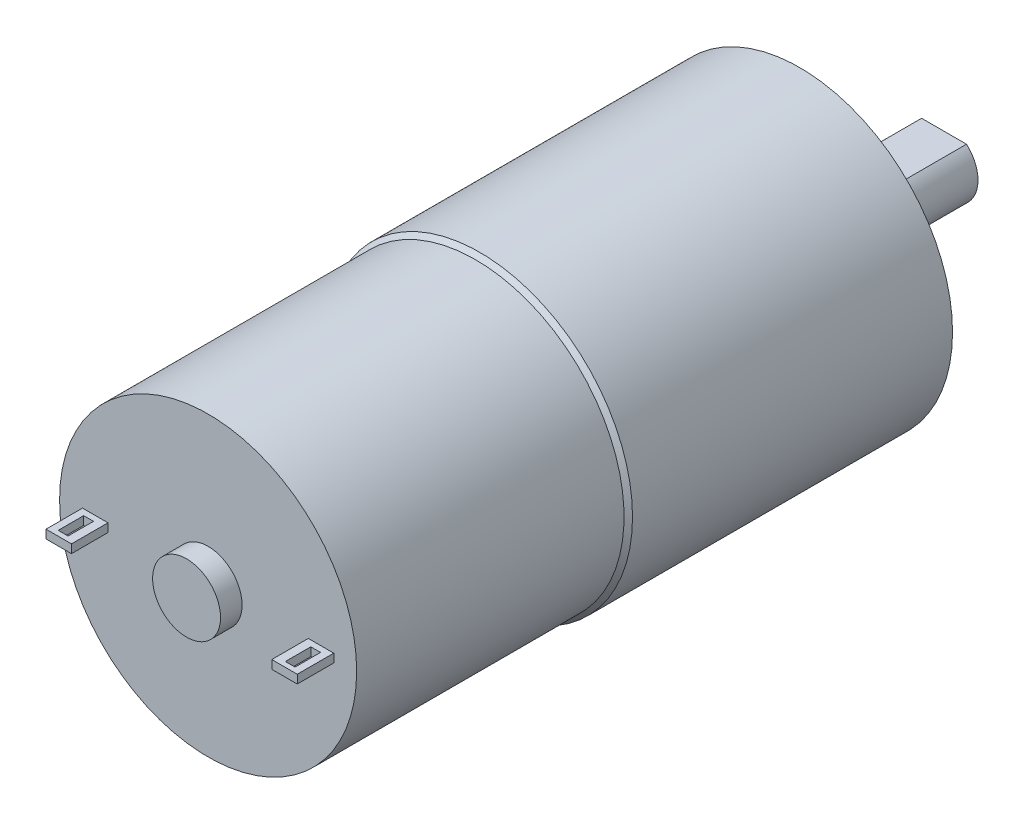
ISO-10303-21;
HEADER;
FILE_DESCRIPTION(('STEP AP214'),'2;1');
FILE_NAME('part.step','',(''),(''),'','','');
FILE_SCHEMA(('AUTOMOTIVE_DESIGN { 1 0 10303 214 1 1 1 1 }'));
ENDSEC;
DATA;
#1=APPLICATION_CONTEXT('core data for automotive mechanical design processes');
#2=APPLICATION_PROTOCOL_DEFINITION('international standard','automotive_design',2000,#1);
#3=PRODUCT_CONTEXT('',#1,'mechanical');
#4=PRODUCT('Part','Part','',(#3));
#5=PRODUCT_RELATED_PRODUCT_CATEGORY('part','',(#4));
#6=PRODUCT_DEFINITION_FORMATION('','',#4);
#7=PRODUCT_DEFINITION_CONTEXT('part definition',#1,'design');
#8=PRODUCT_DEFINITION('design','',#6,#7);
#9=PRODUCT_DEFINITION_SHAPE('','',#8);
#10=(LENGTH_UNIT() NAMED_UNIT(*) SI_UNIT(.MILLI.,.METRE.));
#11=(NAMED_UNIT(*) PLANE_ANGLE_UNIT() SI_UNIT($,.RADIAN.));
#12=(NAMED_UNIT(*) SI_UNIT($,.STERADIAN.) SOLID_ANGLE_UNIT());
#13=UNCERTAINTY_MEASURE_WITH_UNIT(LENGTH_MEASURE(1.E-05),#10,'distance_accuracy_value','');
#14=(GEOMETRIC_REPRESENTATION_CONTEXT(3) GLOBAL_UNCERTAINTY_ASSIGNED_CONTEXT((#13)) GLOBAL_UNIT_ASSIGNED_CONTEXT((#10,
#11,#12)) REPRESENTATION_CONTEXT('',''));
#15=CARTESIAN_POINT('',(0.,0.,0.));
#16=DIRECTION('',(0.,0.,1.));
#17=DIRECTION('',(1.,0.,0.));
#18=AXIS2_PLACEMENT_3D('',#15,#16,#17);
#19=CARTESIAN_POINT('',(0.,0.,69.7));
#20=DIRECTION('',(0.,0.,1.));
#21=DIRECTION('',(1.,0.,0.));
#22=AXIS2_PLACEMENT_3D('',#19,#20,#21);
#23=PLANE('',#22);
#24=CARTESIAN_POINT('',(0.,0.,69.7));
#25=DIRECTION('',(0.,0.,1.));
#26=DIRECTION('',(1.,0.,0.));
#27=AXIS2_PLACEMENT_3D('',#24,#25,#26);
#28=CIRCLE('',#27,4.);
#29=CARTESIAN_POINT('',(4.,0.,69.7));
#30=VERTEX_POINT('',#29);
#31=EDGE_CURVE('E11',#30,#30,#28,.T.);
#32=ORIENTED_EDGE('',*,*,#31,.F.);
#33=EDGE_LOOP('',(#32));
#34=FACE_BOUND('',#33,.T.);
#35=CARTESIAN_POINT('',(0.,0.,69.7));
#36=DIRECTION('',(0.,0.,1.));
#37=DIRECTION('',(1.,0.,0.));
#38=AXIS2_PLACEMENT_3D('',#35,#36,#37);
#39=CIRCLE('',#38,17.5);
#40=CARTESIAN_POINT('',(17.5,0.,69.7));
#41=VERTEX_POINT('',#40);
#42=EDGE_CURVE('E405',#41,#41,#39,.T.);
#43=ORIENTED_EDGE('',*,*,#42,.T.);
#44=EDGE_LOOP('',(#43));
#45=FACE_BOUND('',#44,.T.);
#46=DIRECTION('',(1.,0.,0.));
#47=VECTOR('',#46,1.);
#48=CARTESIAN_POINT('',(-14.8,-0.499999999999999,69.7));
#49=LINE('',#48,#47);
#50=CARTESIAN_POINT('',(-14.8,-0.499999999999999,69.7));
#51=VERTEX_POINT('',#50);
#52=CARTESIAN_POINT('',(-11.8,-0.499999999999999,69.7));
#53=VERTEX_POINT('',#52);
#54=EDGE_CURVE('E353',#51,#53,#49,.T.);
#55=ORIENTED_EDGE('',*,*,#54,.F.);
#56=DIRECTION('',(0.,-1.,0.));
#57=VECTOR('',#56,1.);
#58=CARTESIAN_POINT('',(-14.8,0.500000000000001,69.7));
#59=LINE('',#58,#57);
#60=CARTESIAN_POINT('',(-14.8,0.500000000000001,69.7));
#61=VERTEX_POINT('',#60);
#62=EDGE_CURVE('E306',#61,#51,#59,.T.);
#63=ORIENTED_EDGE('',*,*,#62,.F.);
#64=DIRECTION('',(1.,0.,0.));
#65=VECTOR('',#64,1.);
#66=CARTESIAN_POINT('',(-14.8,0.500000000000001,69.7));
#67=LINE('',#66,#65);
#68=CARTESIAN_POINT('',(-11.8,0.500000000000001,69.7));
#69=VERTEX_POINT('',#68);
#70=EDGE_CURVE('E346',#61,#69,#67,.T.);
#71=ORIENTED_EDGE('',*,*,#70,.T.);
#72=DIRECTION('',(0.,-1.,0.));
#73=VECTOR('',#72,1.);
#74=CARTESIAN_POINT('',(-11.8,0.500000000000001,69.7));
#75=LINE('',#74,#73);
#76=EDGE_CURVE('E349',#69,#53,#75,.T.);
#77=ORIENTED_EDGE('',*,*,#76,.T.);
#78=EDGE_LOOP('',(#55,#63,#71,#77));
#79=FACE_BOUND('',#78,.T.);
#80=DIRECTION('',(1.,0.,0.));
#81=VECTOR('',#80,1.);
#82=CARTESIAN_POINT('',(11.8,-0.5,69.7));
#83=LINE('',#82,#81);
#84=CARTESIAN_POINT('',(11.8,-0.5,69.7));
#85=VERTEX_POINT('',#84);
#86=CARTESIAN_POINT('',(14.8,-0.5,69.7));
#87=VERTEX_POINT('',#86);
#88=EDGE_CURVE('E305',#85,#87,#83,.T.);
#89=ORIENTED_EDGE('',*,*,#88,.F.);
#90=DIRECTION('',(0.,-1.,0.));
#91=VECTOR('',#90,1.);
#92=CARTESIAN_POINT('',(11.8,0.5,69.7));
#93=LINE('',#92,#91);
#94=CARTESIAN_POINT('',(11.8,0.5,69.7));
#95=VERTEX_POINT('',#94);
#96=EDGE_CURVE('E301',#95,#85,#93,.T.);
#97=ORIENTED_EDGE('',*,*,#96,.F.);
#98=DIRECTION('',(1.,0.,0.));
#99=VECTOR('',#98,1.);
#100=CARTESIAN_POINT('',(11.8,0.5,69.7));
#101=LINE('',#100,#99);
#102=CARTESIAN_POINT('',(14.8,0.5,69.7));
#103=VERTEX_POINT('',#102);
#104=EDGE_CURVE('E289',#95,#103,#101,.T.);
#105=ORIENTED_EDGE('',*,*,#104,.T.);
#106=DIRECTION('',(0.,-1.,0.));
#107=VECTOR('',#106,1.);
#108=CARTESIAN_POINT('',(14.8,0.5,69.7));
#109=LINE('',#108,#107);
#110=EDGE_CURVE('E310',#103,#87,#109,.T.);
#111=ORIENTED_EDGE('',*,*,#110,.T.);
#112=EDGE_LOOP('',(#89,#97,#105,#111));
#113=FACE_BOUND('',#112,.T.);
#114=ADVANCED_FACE('F55',(#34,#45,#79,#113),#23,.T.);
#115=CARTESIAN_POINT('',(0.,0.,38.7));
#116=DIRECTION('',(0.,0.,-1.));
#117=DIRECTION('',(-1.,0.,0.));
#118=AXIS2_PLACEMENT_3D('',#115,#116,#117);
#119=CYLINDRICAL_SURFACE('',#118,18.);
#120=CARTESIAN_POINT('',(0.,0.,37.7));
#121=DIRECTION('',(0.,0.,1.));
#122=DIRECTION('',(1.,0.,0.));
#123=AXIS2_PLACEMENT_3D('',#120,#121,#122);
#124=CIRCLE('',#123,18.);
#125=CARTESIAN_POINT('',(18.,0.,37.7));
#126=VERTEX_POINT('',#125);
#127=EDGE_CURVE('E415',#126,#126,#124,.F.);
#128=ORIENTED_EDGE('',*,*,#127,.T.);
#129=EDGE_LOOP('',(#128));
#130=FACE_BOUND('',#129,.T.);
#131=CARTESIAN_POINT('',(0.,0.,0.));
#132=DIRECTION('',(0.,0.,1.));
#133=DIRECTION('',(1.,0.,0.));
#134=AXIS2_PLACEMENT_3D('',#131,#132,#133);
#135=CIRCLE('',#134,18.);
#136=CARTESIAN_POINT('',(18.,0.,0.));
#137=VERTEX_POINT('',#136);
#138=EDGE_CURVE('E412',#137,#137,#135,.T.);
#139=ORIENTED_EDGE('',*,*,#138,.T.);
#140=EDGE_LOOP('',(#139));
#141=FACE_BOUND('',#140,.T.);
#142=ADVANCED_FACE('F443',(#130,#141),#119,.T.);
#143=CARTESIAN_POINT('',(0.,0.,0.));
#144=DIRECTION('',(0.,0.,1.));
#145=DIRECTION('',(1.,0.,0.));
#146=AXIS2_PLACEMENT_3D('',#143,#144,#145);
#147=PLANE('',#146);
#148=CARTESIAN_POINT('',(0.,0.,0.));
#149=DIRECTION('',(0.,0.,-1.));
#150=DIRECTION('',(-1.,0.,0.));
#151=AXIS2_PLACEMENT_3D('',#148,#149,#150);
#152=CIRCLE('',#151,11.);
#153=CARTESIAN_POINT('',(-11.,0.,0.));
#154=VERTEX_POINT('',#153);
#155=EDGE_CURVE('E402',#154,#154,#152,.T.);
#156=ORIENTED_EDGE('',*,*,#155,.F.);
#157=EDGE_LOOP('',(#156));
#158=FACE_BOUND('',#157,.T.);
#159=ORIENTED_EDGE('',*,*,#138,.F.);
#160=EDGE_LOOP('',(#159));
#161=FACE_BOUND('',#160,.T.);
#162=ADVANCED_FACE('F440',(#158,#161),#147,.F.);
#163=CARTESIAN_POINT('',(0.,0.,69.7));
#164=DIRECTION('',(0.,0.,-1.));
#165=DIRECTION('',(-1.,0.,0.));
#166=AXIS2_PLACEMENT_3D('',#163,#164,#165);
#167=CYLINDRICAL_SURFACE('',#166,17.5);
#168=CARTESIAN_POINT('',(0.,0.,38.2));
#169=DIRECTION('',(0.,0.,-1.));
#170=DIRECTION('',(-1.,0.,0.));
#171=AXIS2_PLACEMENT_3D('',#168,#169,#170);
#172=CIRCLE('',#171,17.5);
#173=CARTESIAN_POINT('',(-17.5,0.,38.2));
#174=VERTEX_POINT('',#173);
#175=EDGE_CURVE('E60',#174,#174,#172,.F.);
#176=ORIENTED_EDGE('',*,*,#175,.T.);
#177=EDGE_LOOP('',(#176));
#178=FACE_BOUND('',#177,.T.);
#179=ORIENTED_EDGE('',*,*,#42,.F.);
#180=EDGE_LOOP('',(#179));
#181=FACE_BOUND('',#180,.T.);
#182=ADVANCED_FACE('F426',(#178,#181),#167,.T.);
#183=CARTESIAN_POINT('',(0.,0.,38.7));
#184=DIRECTION('',(0.,0.,-1.));
#185=DIRECTION('',(-1.,0.,0.));
#186=AXIS2_PLACEMENT_3D('',#183,#184,#185);
#187=CONICAL_SURFACE('',#186,17.,0.785398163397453);
#188=ORIENTED_EDGE('',*,*,#127,.F.);
#189=EDGE_LOOP('',(#188));
#190=FACE_BOUND('',#189,.T.);
#191=ORIENTED_EDGE('',*,*,#175,.F.);
#192=EDGE_LOOP('',(#191));
#193=FACE_BOUND('',#192,.T.);
#194=ADVANCED_FACE('F58',(#190,#193),#187,.T.);
#195=CARTESIAN_POINT('',(0.,0.,-2.));
#196=DIRECTION('',(0.,0.,1.));
#197=DIRECTION('',(1.,0.,0.));
#198=AXIS2_PLACEMENT_3D('',#195,#196,#197);
#199=CYLINDRICAL_SURFACE('',#198,11.);
#200=CARTESIAN_POINT('',(0.,0.,-2.));
#201=DIRECTION('',(0.,0.,-1.));
#202=DIRECTION('',(-1.,0.,0.));
#203=AXIS2_PLACEMENT_3D('',#200,#201,#202);
#204=CIRCLE('',#203,11.);
#205=CARTESIAN_POINT('',(-11.,0.,-2.));
#206=VERTEX_POINT('',#205);
#207=EDGE_CURVE('E398',#206,#206,#204,.T.);
#208=ORIENTED_EDGE('',*,*,#207,.F.);
#209=EDGE_LOOP('',(#208));
#210=FACE_BOUND('',#209,.T.);
#211=ORIENTED_EDGE('',*,*,#155,.T.);
#212=EDGE_LOOP('',(#211));
#213=FACE_BOUND('',#212,.T.);
#214=ADVANCED_FACE('F430',(#210,#213),#199,.T.);
#215=CARTESIAN_POINT('',(0.,0.,-2.));
#216=DIRECTION('',(0.,0.,-1.));
#217=DIRECTION('',(-1.,0.,0.));
#218=AXIS2_PLACEMENT_3D('',#215,#216,#217);
#219=PLANE('',#218);
#220=CARTESIAN_POINT('',(0.,0.,-2.));
#221=DIRECTION('',(0.,0.,-1.));
#222=DIRECTION('',(-1.,0.,0.));
#223=AXIS2_PLACEMENT_3D('',#220,#221,#222);
#224=CIRCLE('',#223,4.);
#225=CARTESIAN_POINT('',(-4.,0.,-2.));
#226=VERTEX_POINT('',#225);
#227=EDGE_CURVE('E66',#226,#226,#224,.T.);
#228=ORIENTED_EDGE('',*,*,#227,.F.);
#229=EDGE_LOOP('',(#228));
#230=FACE_BOUND('',#229,.T.);
#231=ORIENTED_EDGE('',*,*,#207,.T.);
#232=EDGE_LOOP('',(#231));
#233=FACE_BOUND('',#232,.T.);
#234=ADVANCED_FACE('F436',(#230,#233),#219,.T.);
#235=CARTESIAN_POINT('',(0.,0.,-17.));
#236=DIRECTION('',(0.,0.,1.));
#237=DIRECTION('',(1.,0.,0.));
#238=AXIS2_PLACEMENT_3D('',#235,#236,#237);
#239=CYLINDRICAL_SURFACE('',#238,4.);
#240=CARTESIAN_POINT('',(0.,0.,-17.));
#241=DIRECTION('',(0.,0.,-1.));
#242=DIRECTION('',(-1.,0.,0.));
#243=AXIS2_PLACEMENT_3D('',#240,#241,#242);
#244=CIRCLE('',#243,4.);
#245=CARTESIAN_POINT('',(2.64575131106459,3.,-17.));
#246=VERTEX_POINT('',#245);
#247=CARTESIAN_POINT('',(-2.64575131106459,3.,-17.));
#248=VERTEX_POINT('',#247);
#249=EDGE_CURVE('E391',#246,#248,#244,.T.);
#250=ORIENTED_EDGE('',*,*,#249,.F.);
#251=DIRECTION('',(0.,0.,-1.));
#252=VECTOR('',#251,1.);
#253=CARTESIAN_POINT('',(2.64575131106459,3.,-5.));
#254=LINE('',#253,#252);
#255=CARTESIAN_POINT('',(2.64575131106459,3.,-5.));
#256=VERTEX_POINT('',#255);
#257=EDGE_CURVE('E388',#256,#246,#254,.T.);
#258=ORIENTED_EDGE('',*,*,#257,.F.);
#259=CARTESIAN_POINT('',(0.,0.,-5.));
#260=DIRECTION('',(0.,0.,-1.));
#261=DIRECTION('',(-1.,0.,0.));
#262=AXIS2_PLACEMENT_3D('',#259,#260,#261);
#263=CIRCLE('',#262,4.);
#264=CARTESIAN_POINT('',(-2.64575131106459,3.,-5.));
#265=VERTEX_POINT('',#264);
#266=EDGE_CURVE('E381',#265,#256,#263,.T.);
#267=ORIENTED_EDGE('',*,*,#266,.F.);
#268=DIRECTION('',(0.,0.,-1.));
#269=VECTOR('',#268,1.);
#270=CARTESIAN_POINT('',(-2.64575131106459,3.,-5.));
#271=LINE('',#270,#269);
#272=EDGE_CURVE('E385',#265,#248,#271,.T.);
#273=ORIENTED_EDGE('',*,*,#272,.T.);
#274=EDGE_LOOP('',(#250,#258,#267,#273));
#275=FACE_BOUND('',#274,.T.);
#276=ORIENTED_EDGE('',*,*,#227,.T.);
#277=EDGE_LOOP('',(#276));
#278=FACE_BOUND('',#277,.T.);
#279=ADVANCED_FACE('F476',(#275,#278),#239,.T.);
#280=CARTESIAN_POINT('',(0.,0.,-17.));
#281=DIRECTION('',(0.,0.,-1.));
#282=DIRECTION('',(-1.,0.,0.));
#283=AXIS2_PLACEMENT_3D('',#280,#281,#282);
#284=PLANE('',#283);
#285=DIRECTION('',(-1.,0.,0.));
#286=VECTOR('',#285,1.);
#287=CARTESIAN_POINT('',(2.64575131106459,3.,-17.));
#288=LINE('',#287,#286);
#289=EDGE_CURVE('E375',#246,#248,#288,.T.);
#290=ORIENTED_EDGE('',*,*,#289,.F.);
#291=ORIENTED_EDGE('',*,*,#249,.T.);
#292=EDGE_LOOP('',(#290,#291));
#293=FACE_BOUND('',#292,.T.);
#294=ADVANCED_FACE('F483',(#293),#284,.T.);
#295=CARTESIAN_POINT('',(2.64575131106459,3.,-5.));
#296=DIRECTION('',(0.,-1.,0.));
#297=DIRECTION('',(0.,0.,-1.));
#298=AXIS2_PLACEMENT_3D('',#295,#296,#297);
#299=PLANE('',#298);
#300=ORIENTED_EDGE('',*,*,#289,.T.);
#301=ORIENTED_EDGE('',*,*,#272,.F.);
#302=DIRECTION('',(-1.,0.,0.));
#303=VECTOR('',#302,1.);
#304=CARTESIAN_POINT('',(2.64575131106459,3.,-5.));
#305=LINE('',#304,#303);
#306=EDGE_CURVE('E377',#256,#265,#305,.T.);
#307=ORIENTED_EDGE('',*,*,#306,.F.);
#308=ORIENTED_EDGE('',*,*,#257,.T.);
#309=EDGE_LOOP('',(#300,#301,#307,#308));
#310=FACE_BOUND('',#309,.T.);
#311=ADVANCED_FACE('F491',(#310),#299,.F.);
#312=CARTESIAN_POINT('',(0.,0.,-5.));
#313=DIRECTION('',(0.,0.,-1.));
#314=DIRECTION('',(-1.,0.,0.));
#315=AXIS2_PLACEMENT_3D('',#312,#313,#314);
#316=PLANE('',#315);
#317=ORIENTED_EDGE('',*,*,#306,.T.);
#318=ORIENTED_EDGE('',*,*,#266,.T.);
#319=EDGE_LOOP('',(#317,#318));
#320=FACE_BOUND('',#319,.T.);
#321=ADVANCED_FACE('F752',(#320),#316,.T.);
#322=CARTESIAN_POINT('',(0.,0.,72.24));
#323=DIRECTION('',(0.,0.,-1.));
#324=DIRECTION('',(-1.,0.,0.));
#325=AXIS2_PLACEMENT_3D('',#322,#323,#324);
#326=CYLINDRICAL_SURFACE('',#325,4.);
#327=CARTESIAN_POINT('',(0.,0.,72.24));
#328=DIRECTION('',(0.,0.,1.));
#329=DIRECTION('',(1.,0.,0.));
#330=AXIS2_PLACEMENT_3D('',#327,#328,#329);
#331=CIRCLE('',#330,4.);
#332=CARTESIAN_POINT('',(4.,0.,72.24));
#333=VERTEX_POINT('',#332);
#334=EDGE_CURVE('E329',#333,#333,#331,.T.);
#335=ORIENTED_EDGE('',*,*,#334,.F.);
#336=EDGE_LOOP('',(#335));
#337=FACE_BOUND('',#336,.T.);
#338=ORIENTED_EDGE('',*,*,#31,.T.);
#339=EDGE_LOOP('',(#338));
#340=FACE_BOUND('',#339,.T.);
#341=ADVANCED_FACE('F741',(#337,#340),#326,.T.);
#342=CARTESIAN_POINT('',(0.,0.,72.24));
#343=DIRECTION('',(0.,0.,1.));
#344=DIRECTION('',(1.,0.,0.));
#345=AXIS2_PLACEMENT_3D('',#342,#343,#344);
#346=PLANE('',#345);
#347=ORIENTED_EDGE('',*,*,#334,.T.);
#348=EDGE_LOOP('',(#347));
#349=FACE_BOUND('',#348,.T.);
#350=ADVANCED_FACE('F501',(#349),#346,.T.);
#351=CARTESIAN_POINT('',(-14.8,0.500000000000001,74.));
#352=DIRECTION('',(1.,0.,0.));
#353=DIRECTION('',(0.,0.,-1.));
#354=AXIS2_PLACEMENT_3D('',#351,#352,#353);
#355=PLANE('',#354);
#356=ORIENTED_EDGE('',*,*,#62,.T.);
#357=DIRECTION('',(0.,0.,-1.));
#358=VECTOR('',#357,1.);
#359=CARTESIAN_POINT('',(-14.8,-0.499999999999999,74.));
#360=LINE('',#359,#358);
#361=CARTESIAN_POINT('',(-14.8,-0.499999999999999,74.));
#362=VERTEX_POINT('',#361);
#363=EDGE_CURVE('E283',#362,#51,#360,.T.);
#364=ORIENTED_EDGE('',*,*,#363,.F.);
#365=DIRECTION('',(0.,-1.,0.));
#366=VECTOR('',#365,1.);
#367=CARTESIAN_POINT('',(-14.8,0.500000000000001,74.));
#368=LINE('',#367,#366);
#369=CARTESIAN_POINT('',(-14.8,0.500000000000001,74.));
#370=VERTEX_POINT('',#369);
#371=EDGE_CURVE('E350',#370,#362,#368,.T.);
#372=ORIENTED_EDGE('',*,*,#371,.F.);
#373=DIRECTION('',(0.,0.,-1.));
#374=VECTOR('',#373,1.);
#375=CARTESIAN_POINT('',(-14.8,0.500000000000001,74.));
#376=LINE('',#375,#374);
#377=EDGE_CURVE('E341',#370,#61,#376,.T.);
#378=ORIENTED_EDGE('',*,*,#377,.T.);
#379=EDGE_LOOP('',(#356,#364,#372,#378));
#380=FACE_BOUND('',#379,.T.);
#381=ADVANCED_FACE('F497',(#380),#355,.F.);
#382=CARTESIAN_POINT('',(-14.8,-0.499999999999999,74.));
#383=DIRECTION('',(0.,1.,0.));
#384=DIRECTION('',(0.,0.,1.));
#385=AXIS2_PLACEMENT_3D('',#382,#383,#384);
#386=PLANE('',#385);
#387=DIRECTION('',(1.,0.,0.));
#388=VECTOR('',#387,1.);
#389=CARTESIAN_POINT('',(-14.8,-0.499999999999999,73.4));
#390=LINE('',#389,#388);
#391=CARTESIAN_POINT('',(-13.9628480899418,-0.5,73.4));
#392=VERTEX_POINT('',#391);
#393=CARTESIAN_POINT('',(-12.8,-0.5,73.4));
#394=VERTEX_POINT('',#393);
#395=EDGE_CURVE('E275',#392,#394,#390,.T.);
#396=ORIENTED_EDGE('',*,*,#395,.T.);
#397=DIRECTION('',(0.,0.,-1.));
#398=VECTOR('',#397,1.);
#399=CARTESIAN_POINT('',(-12.8,-0.499999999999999,74.));
#400=LINE('',#399,#398);
#401=CARTESIAN_POINT('',(-12.8,-0.5,70.4));
#402=VERTEX_POINT('',#401);
#403=EDGE_CURVE('E279',#394,#402,#400,.T.);
#404=ORIENTED_EDGE('',*,*,#403,.T.);
#405=DIRECTION('',(-1.,0.,0.));
#406=VECTOR('',#405,1.);
#407=CARTESIAN_POINT('',(-14.8,-0.499999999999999,70.4));
#408=LINE('',#407,#406);
#409=CARTESIAN_POINT('',(-13.9628480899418,-0.499999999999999,70.4));
#410=VERTEX_POINT('',#409);
#411=EDGE_CURVE('E267',#402,#410,#408,.T.);
#412=ORIENTED_EDGE('',*,*,#411,.T.);
#413=DIRECTION('',(0.,0.,1.));
#414=VECTOR('',#413,1.);
#415=CARTESIAN_POINT('',(-13.9628480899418,-0.499999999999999,74.));
#416=LINE('',#415,#414);
#417=EDGE_CURVE('E271',#410,#392,#416,.T.);
#418=ORIENTED_EDGE('',*,*,#417,.T.);
#419=EDGE_LOOP('',(#396,#404,#412,#418));
#420=FACE_BOUND('',#419,.T.);
#421=ORIENTED_EDGE('',*,*,#54,.T.);
#422=DIRECTION('',(0.,0.,-1.));
#423=VECTOR('',#422,1.);
#424=CARTESIAN_POINT('',(-11.8,-0.499999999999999,74.));
#425=LINE('',#424,#423);
#426=CARTESIAN_POINT('',(-11.8,-0.499999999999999,74.));
#427=VERTEX_POINT('',#426);
#428=EDGE_CURVE('E333',#427,#53,#425,.T.);
#429=ORIENTED_EDGE('',*,*,#428,.F.);
#430=DIRECTION('',(1.,0.,0.));
#431=VECTOR('',#430,1.);
#432=CARTESIAN_POINT('',(-14.8,-0.499999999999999,74.));
#433=LINE('',#432,#431);
#434=EDGE_CURVE('E367',#362,#427,#433,.T.);
#435=ORIENTED_EDGE('',*,*,#434,.F.);
#436=ORIENTED_EDGE('',*,*,#363,.T.);
#437=EDGE_LOOP('',(#421,#429,#435,#436));
#438=FACE_BOUND('',#437,.T.);
#439=ADVANCED_FACE('F500',(#420,#438),#386,.F.);
#440=CARTESIAN_POINT('',(-11.8,0.500000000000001,74.));
#441=DIRECTION('',(1.,0.,0.));
#442=DIRECTION('',(0.,0.,-1.));
#443=AXIS2_PLACEMENT_3D('',#440,#441,#442);
#444=PLANE('',#443);
#445=ORIENTED_EDGE('',*,*,#76,.F.);
#446=DIRECTION('',(0.,0.,-1.));
#447=VECTOR('',#446,1.);
#448=CARTESIAN_POINT('',(-11.8,0.500000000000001,74.));
#449=LINE('',#448,#447);
#450=CARTESIAN_POINT('',(-11.8,0.500000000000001,74.));
#451=VERTEX_POINT('',#450);
#452=EDGE_CURVE('E337',#451,#69,#449,.T.);
#453=ORIENTED_EDGE('',*,*,#452,.F.);
#454=DIRECTION('',(0.,-1.,0.));
#455=VECTOR('',#454,1.);
#456=CARTESIAN_POINT('',(-11.8,0.500000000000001,74.));
#457=LINE('',#456,#455);
#458=EDGE_CURVE('E363',#451,#427,#457,.T.);
#459=ORIENTED_EDGE('',*,*,#458,.T.);
#460=ORIENTED_EDGE('',*,*,#428,.T.);
#461=EDGE_LOOP('',(#445,#453,#459,#460));
#462=FACE_BOUND('',#461,.T.);
#463=ADVANCED_FACE('F509',(#462),#444,.T.);
#464=CARTESIAN_POINT('',(-14.8,0.500000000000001,74.));
#465=DIRECTION('',(0.,1.,0.));
#466=DIRECTION('',(0.,0.,1.));
#467=AXIS2_PLACEMENT_3D('',#464,#465,#466);
#468=PLANE('',#467);
#469=DIRECTION('',(0.,0.,-1.));
#470=VECTOR('',#469,1.);
#471=CARTESIAN_POINT('',(-12.8,0.5,70.4));
#472=LINE('',#471,#470);
#473=CARTESIAN_POINT('',(-12.8,0.5,73.4));
#474=VERTEX_POINT('',#473);
#475=CARTESIAN_POINT('',(-12.8,0.500000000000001,70.4));
#476=VERTEX_POINT('',#475);
#477=EDGE_CURVE('E82',#474,#476,#472,.T.);
#478=ORIENTED_EDGE('',*,*,#477,.F.);
#479=DIRECTION('',(1.,0.,0.));
#480=VECTOR('',#479,1.);
#481=CARTESIAN_POINT('',(-13.9628480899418,0.5,73.4));
#482=LINE('',#481,#480);
#483=CARTESIAN_POINT('',(-13.9628480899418,0.5,73.4));
#484=VERTEX_POINT('',#483);
#485=EDGE_CURVE('E234',#484,#474,#482,.T.);
#486=ORIENTED_EDGE('',*,*,#485,.F.);
#487=DIRECTION('',(0.,0.,1.));
#488=VECTOR('',#487,1.);
#489=CARTESIAN_POINT('',(-13.9628480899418,0.5,70.4));
#490=LINE('',#489,#488);
#491=CARTESIAN_POINT('',(-13.9628480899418,0.5,70.4));
#492=VERTEX_POINT('',#491);
#493=EDGE_CURVE('E246',#492,#484,#490,.T.);
#494=ORIENTED_EDGE('',*,*,#493,.F.);
#495=DIRECTION('',(-1.,0.,0.));
#496=VECTOR('',#495,1.);
#497=CARTESIAN_POINT('',(-13.9628480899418,0.5,70.4));
#498=LINE('',#497,#496);
#499=EDGE_CURVE('E250',#476,#492,#498,.T.);
#500=ORIENTED_EDGE('',*,*,#499,.F.);
#501=EDGE_LOOP('',(#478,#486,#494,#500));
#502=FACE_BOUND('',#501,.T.);
#503=ORIENTED_EDGE('',*,*,#70,.F.);
#504=ORIENTED_EDGE('',*,*,#377,.F.);
#505=DIRECTION('',(1.,0.,0.));
#506=VECTOR('',#505,1.);
#507=CARTESIAN_POINT('',(-14.8,0.500000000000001,74.));
#508=LINE('',#507,#506);
#509=EDGE_CURVE('E345',#370,#451,#508,.T.);
#510=ORIENTED_EDGE('',*,*,#509,.T.);
#511=ORIENTED_EDGE('',*,*,#452,.T.);
#512=EDGE_LOOP('',(#503,#504,#510,#511));
#513=FACE_BOUND('',#512,.T.);
#514=ADVANCED_FACE('F517',(#502,#513),#468,.T.);
#515=CARTESIAN_POINT('',(0.,0.,74.));
#516=DIRECTION('',(0.,0.,1.));
#517=DIRECTION('',(1.,0.,0.));
#518=AXIS2_PLACEMENT_3D('',#515,#516,#517);
#519=PLANE('',#518);
#520=ORIENTED_EDGE('',*,*,#371,.T.);
#521=ORIENTED_EDGE('',*,*,#434,.T.);
#522=ORIENTED_EDGE('',*,*,#458,.F.);
#523=ORIENTED_EDGE('',*,*,#509,.F.);
#524=EDGE_LOOP('',(#520,#521,#522,#523));
#525=FACE_BOUND('',#524,.T.);
#526=ADVANCED_FACE('F525',(#525),#519,.T.);
#527=CARTESIAN_POINT('',(11.8,0.5,74.));
#528=DIRECTION('',(1.,0.,0.));
#529=DIRECTION('',(0.,0.,-1.));
#530=AXIS2_PLACEMENT_3D('',#527,#528,#529);
#531=PLANE('',#530);
#532=ORIENTED_EDGE('',*,*,#96,.T.);
#533=DIRECTION('',(0.,0.,-1.));
#534=VECTOR('',#533,1.);
#535=CARTESIAN_POINT('',(11.8,-0.5,74.));
#536=LINE('',#535,#534);
#537=CARTESIAN_POINT('',(11.8,-0.5,74.));
#538=VERTEX_POINT('',#537);
#539=EDGE_CURVE('E325',#538,#85,#536,.T.);
#540=ORIENTED_EDGE('',*,*,#539,.F.);
#541=DIRECTION('',(0.,-1.,0.));
#542=VECTOR('',#541,1.);
#543=CARTESIAN_POINT('',(11.8,0.5,74.));
#544=LINE('',#543,#542);
#545=CARTESIAN_POINT('',(11.8,0.5,74.));
#546=VERTEX_POINT('',#545);
#547=EDGE_CURVE('E284',#546,#538,#544,.T.);
#548=ORIENTED_EDGE('',*,*,#547,.F.);
#549=DIRECTION('',(0.,0.,-1.));
#550=VECTOR('',#549,1.);
#551=CARTESIAN_POINT('',(11.8,0.5,74.));
#552=LINE('',#551,#550);
#553=EDGE_CURVE('E300',#546,#95,#552,.T.);
#554=ORIENTED_EDGE('',*,*,#553,.T.);
#555=EDGE_LOOP('',(#532,#540,#548,#554));
#556=FACE_BOUND('',#555,.T.);
#557=ADVANCED_FACE('F533',(#556),#531,.F.);
#558=CARTESIAN_POINT('',(11.8,-0.5,74.));
#559=DIRECTION('',(0.,1.,0.));
#560=DIRECTION('',(-1.,0.,0.));
#561=AXIS2_PLACEMENT_3D('',#558,#559,#560);
#562=PLANE('',#561);
#563=DIRECTION('',(1.,0.,0.));
#564=VECTOR('',#563,1.);
#565=CARTESIAN_POINT('',(11.8,-0.5,73.4));
#566=LINE('',#565,#564);
#567=CARTESIAN_POINT('',(12.8,-0.500000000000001,73.4));
#568=VERTEX_POINT('',#567);
#569=CARTESIAN_POINT('',(13.9428776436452,-0.500000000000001,73.4));
#570=VERTEX_POINT('',#569);
#571=EDGE_CURVE('E259',#568,#570,#566,.T.);
#572=ORIENTED_EDGE('',*,*,#571,.T.);
#573=DIRECTION('',(0.,0.,-1.));
#574=VECTOR('',#573,1.);
#575=CARTESIAN_POINT('',(13.9428776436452,-0.5,74.));
#576=LINE('',#575,#574);
#577=CARTESIAN_POINT('',(13.9428776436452,-0.500000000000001,70.4));
#578=VERTEX_POINT('',#577);
#579=EDGE_CURVE('E263',#570,#578,#576,.T.);
#580=ORIENTED_EDGE('',*,*,#579,.T.);
#581=DIRECTION('',(-1.,0.,0.));
#582=VECTOR('',#581,1.);
#583=CARTESIAN_POINT('',(11.8,-0.5,70.4));
#584=LINE('',#583,#582);
#585=CARTESIAN_POINT('',(12.8,-0.5,70.4));
#586=VERTEX_POINT('',#585);
#587=EDGE_CURVE('E226',#578,#586,#584,.T.);
#588=ORIENTED_EDGE('',*,*,#587,.T.);
#589=DIRECTION('',(0.,0.,1.));
#590=VECTOR('',#589,1.);
#591=CARTESIAN_POINT('',(12.8,-0.5,74.));
#592=LINE('',#591,#590);
#593=EDGE_CURVE('E193',#586,#568,#592,.T.);
#594=ORIENTED_EDGE('',*,*,#593,.T.);
#595=EDGE_LOOP('',(#572,#580,#588,#594));
#596=FACE_BOUND('',#595,.T.);
#597=ORIENTED_EDGE('',*,*,#88,.T.);
#598=DIRECTION('',(0.,0.,-1.));
#599=VECTOR('',#598,1.);
#600=CARTESIAN_POINT('',(14.8,-0.5,74.));
#601=LINE('',#600,#599);
#602=CARTESIAN_POINT('',(14.8,-0.5,74.));
#603=VERTEX_POINT('',#602);
#604=EDGE_CURVE('E321',#603,#87,#601,.T.);
#605=ORIENTED_EDGE('',*,*,#604,.F.);
#606=DIRECTION('',(1.,0.,0.));
#607=VECTOR('',#606,1.);
#608=CARTESIAN_POINT('',(11.8,-0.5,74.));
#609=LINE('',#608,#607);
#610=EDGE_CURVE('E288',#538,#603,#609,.T.);
#611=ORIENTED_EDGE('',*,*,#610,.F.);
#612=ORIENTED_EDGE('',*,*,#539,.T.);
#613=EDGE_LOOP('',(#597,#605,#611,#612));
#614=FACE_BOUND('',#613,.T.);
#615=ADVANCED_FACE('F541',(#596,#614),#562,.F.);
#616=CARTESIAN_POINT('',(14.8,0.5,74.));
#617=DIRECTION('',(1.,0.,0.));
#618=DIRECTION('',(0.,0.,-1.));
#619=AXIS2_PLACEMENT_3D('',#616,#617,#618);
#620=PLANE('',#619);
#621=ORIENTED_EDGE('',*,*,#110,.F.);
#622=DIRECTION('',(0.,0.,-1.));
#623=VECTOR('',#622,1.);
#624=CARTESIAN_POINT('',(14.8,0.5,74.));
#625=LINE('',#624,#623);
#626=CARTESIAN_POINT('',(14.8,0.5,74.));
#627=VERTEX_POINT('',#626);
#628=EDGE_CURVE('E317',#627,#103,#625,.T.);
#629=ORIENTED_EDGE('',*,*,#628,.F.);
#630=DIRECTION('',(0.,-1.,0.));
#631=VECTOR('',#630,1.);
#632=CARTESIAN_POINT('',(14.8,0.5,74.));
#633=LINE('',#632,#631);
#634=EDGE_CURVE('E292',#627,#603,#633,.T.);
#635=ORIENTED_EDGE('',*,*,#634,.T.);
#636=ORIENTED_EDGE('',*,*,#604,.T.);
#637=EDGE_LOOP('',(#621,#629,#635,#636));
#638=FACE_BOUND('',#637,.T.);
#639=ADVANCED_FACE('F549',(#638),#620,.T.);
#640=CARTESIAN_POINT('',(11.8,0.5,74.));
#641=DIRECTION('',(0.,1.,0.));
#642=DIRECTION('',(0.,0.,1.));
#643=AXIS2_PLACEMENT_3D('',#640,#641,#642);
#644=PLANE('',#643);
#645=DIRECTION('',(0.,0.,-1.));
#646=VECTOR('',#645,1.);
#647=CARTESIAN_POINT('',(13.9428776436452,0.5,73.4));
#648=LINE('',#647,#646);
#649=CARTESIAN_POINT('',(13.9428776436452,0.5,73.4));
#650=VERTEX_POINT('',#649);
#651=CARTESIAN_POINT('',(13.9428776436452,0.5,70.4));
#652=VERTEX_POINT('',#651);
#653=EDGE_CURVE('E208',#650,#652,#648,.T.);
#654=ORIENTED_EDGE('',*,*,#653,.F.);
#655=DIRECTION('',(1.,0.,0.));
#656=VECTOR('',#655,1.);
#657=CARTESIAN_POINT('',(12.8,0.5,73.4));
#658=LINE('',#657,#656);
#659=CARTESIAN_POINT('',(12.8,0.5,73.4));
#660=VERTEX_POINT('',#659);
#661=EDGE_CURVE('E213',#660,#650,#658,.T.);
#662=ORIENTED_EDGE('',*,*,#661,.F.);
#663=DIRECTION('',(0.,0.,1.));
#664=VECTOR('',#663,1.);
#665=CARTESIAN_POINT('',(12.8,0.5,73.4));
#666=LINE('',#665,#664);
#667=CARTESIAN_POINT('',(12.8,0.5,70.4));
#668=VERTEX_POINT('',#667);
#669=EDGE_CURVE('E190',#668,#660,#666,.T.);
#670=ORIENTED_EDGE('',*,*,#669,.F.);
#671=DIRECTION('',(-1.,0.,0.));
#672=VECTOR('',#671,1.);
#673=CARTESIAN_POINT('',(12.8,0.5,70.4));
#674=LINE('',#673,#672);
#675=EDGE_CURVE('E202',#652,#668,#674,.T.);
#676=ORIENTED_EDGE('',*,*,#675,.F.);
#677=EDGE_LOOP('',(#654,#662,#670,#676));
#678=FACE_BOUND('',#677,.T.);
#679=ORIENTED_EDGE('',*,*,#104,.F.);
#680=ORIENTED_EDGE('',*,*,#553,.F.);
#681=DIRECTION('',(1.,0.,0.));
#682=VECTOR('',#681,1.);
#683=CARTESIAN_POINT('',(11.8,0.5,74.));
#684=LINE('',#683,#682);
#685=EDGE_CURVE('E296',#546,#627,#684,.T.);
#686=ORIENTED_EDGE('',*,*,#685,.T.);
#687=ORIENTED_EDGE('',*,*,#628,.T.);
#688=EDGE_LOOP('',(#679,#680,#686,#687));
#689=FACE_BOUND('',#688,.T.);
#690=ADVANCED_FACE('F210',(#678,#689),#644,.T.);
#691=CARTESIAN_POINT('',(0.,0.,74.));
#692=DIRECTION('',(0.,0.,1.));
#693=DIRECTION('',(1.,0.,0.));
#694=AXIS2_PLACEMENT_3D('',#691,#692,#693);
#695=PLANE('',#694);
#696=ORIENTED_EDGE('',*,*,#547,.T.);
#697=ORIENTED_EDGE('',*,*,#610,.T.);
#698=ORIENTED_EDGE('',*,*,#634,.F.);
#699=ORIENTED_EDGE('',*,*,#685,.F.);
#700=EDGE_LOOP('',(#696,#697,#698,#699));
#701=FACE_BOUND('',#700,.T.);
#702=ADVANCED_FACE('F564',(#701),#695,.T.);
#703=CARTESIAN_POINT('',(13.9428776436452,-3.8,73.4));
#704=DIRECTION('',(1.,0.,0.));
#705=DIRECTION('',(0.,0.,-1.));
#706=AXIS2_PLACEMENT_3D('',#703,#704,#705);
#707=PLANE('',#706);
#708=DIRECTION('',(0.,1.,0.));
#709=VECTOR('',#708,1.);
#710=CARTESIAN_POINT('',(13.9428776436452,-3.8,73.4));
#711=LINE('',#710,#709);
#712=EDGE_CURVE('E223',#570,#650,#711,.T.);
#713=ORIENTED_EDGE('',*,*,#712,.T.);
#714=ORIENTED_EDGE('',*,*,#653,.T.);
#715=DIRECTION('',(0.,1.,0.));
#716=VECTOR('',#715,1.);
#717=CARTESIAN_POINT('',(13.9428776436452,-3.8,70.4));
#718=LINE('',#717,#716);
#719=EDGE_CURVE('E198',#578,#652,#718,.T.);
#720=ORIENTED_EDGE('',*,*,#719,.F.);
#721=ORIENTED_EDGE('',*,*,#579,.F.);
#722=EDGE_LOOP('',(#713,#714,#720,#721));
#723=FACE_BOUND('',#722,.T.);
#724=ADVANCED_FACE('F570',(#723),#707,.F.);
#725=CARTESIAN_POINT('',(12.8,-3.8,73.4));
#726=DIRECTION('',(0.,0.,1.));
#727=DIRECTION('',(1.,0.,0.));
#728=AXIS2_PLACEMENT_3D('',#725,#726,#727);
#729=PLANE('',#728);
#730=DIRECTION('',(0.,1.,0.));
#731=VECTOR('',#730,1.);
#732=CARTESIAN_POINT('',(12.8,-3.8,73.4));
#733=LINE('',#732,#731);
#734=EDGE_CURVE('E197',#568,#660,#733,.T.);
#735=ORIENTED_EDGE('',*,*,#734,.T.);
#736=ORIENTED_EDGE('',*,*,#661,.T.);
#737=ORIENTED_EDGE('',*,*,#712,.F.);
#738=ORIENTED_EDGE('',*,*,#571,.F.);
#739=EDGE_LOOP('',(#735,#736,#737,#738));
#740=FACE_BOUND('',#739,.T.);
#741=ADVANCED_FACE('F584',(#740),#729,.F.);
#742=CARTESIAN_POINT('',(12.8,-3.8,73.4));
#743=DIRECTION('',(-1.,0.,0.));
#744=DIRECTION('',(0.,0.,1.));
#745=AXIS2_PLACEMENT_3D('',#742,#743,#744);
#746=PLANE('',#745);
#747=DIRECTION('',(0.,1.,0.));
#748=VECTOR('',#747,1.);
#749=CARTESIAN_POINT('',(12.8,-3.8,70.4));
#750=LINE('',#749,#748);
#751=EDGE_CURVE('E185',#586,#668,#750,.T.);
#752=ORIENTED_EDGE('',*,*,#751,.T.);
#753=ORIENTED_EDGE('',*,*,#669,.T.);
#754=ORIENTED_EDGE('',*,*,#734,.F.);
#755=ORIENTED_EDGE('',*,*,#593,.F.);
#756=EDGE_LOOP('',(#752,#753,#754,#755));
#757=FACE_BOUND('',#756,.T.);
#758=ADVANCED_FACE('F187',(#757),#746,.F.);
#759=CARTESIAN_POINT('',(12.8,-3.8,70.4));
#760=DIRECTION('',(0.,0.,-1.));
#761=DIRECTION('',(-1.,0.,0.));
#762=AXIS2_PLACEMENT_3D('',#759,#760,#761);
#763=PLANE('',#762);
#764=ORIENTED_EDGE('',*,*,#719,.T.);
#765=ORIENTED_EDGE('',*,*,#675,.T.);
#766=ORIENTED_EDGE('',*,*,#751,.F.);
#767=ORIENTED_EDGE('',*,*,#587,.F.);
#768=EDGE_LOOP('',(#764,#765,#766,#767));
#769=FACE_BOUND('',#768,.T.);
#770=ADVANCED_FACE('F203',(#769),#763,.F.);
#771=CARTESIAN_POINT('',(-12.8,-3.8,70.4));
#772=DIRECTION('',(1.,0.,0.));
#773=DIRECTION('',(0.,0.,-1.));
#774=AXIS2_PLACEMENT_3D('',#771,#772,#773);
#775=PLANE('',#774);
#776=DIRECTION('',(0.,1.,0.));
#777=VECTOR('',#776,1.);
#778=CARTESIAN_POINT('',(-12.8,-3.8,73.4));
#779=LINE('',#778,#777);
#780=EDGE_CURVE('E240',#394,#474,#779,.T.);
#781=ORIENTED_EDGE('',*,*,#780,.T.);
#782=ORIENTED_EDGE('',*,*,#477,.T.);
#783=DIRECTION('',(0.,1.,0.));
#784=VECTOR('',#783,1.);
#785=CARTESIAN_POINT('',(-12.8,-3.8,70.4));
#786=LINE('',#785,#784);
#787=EDGE_CURVE('E231',#402,#476,#786,.T.);
#788=ORIENTED_EDGE('',*,*,#787,.F.);
#789=ORIENTED_EDGE('',*,*,#403,.F.);
#790=EDGE_LOOP('',(#781,#782,#788,#789));
#791=FACE_BOUND('',#790,.T.);
#792=ADVANCED_FACE('F602',(#791),#775,.F.);
#793=CARTESIAN_POINT('',(-13.9628480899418,-3.8,73.4));
#794=DIRECTION('',(0.,0.,1.));
#795=DIRECTION('',(1.,0.,0.));
#796=AXIS2_PLACEMENT_3D('',#793,#794,#795);
#797=PLANE('',#796);
#798=DIRECTION('',(0.,1.,0.));
#799=VECTOR('',#798,1.);
#800=CARTESIAN_POINT('',(-13.9628480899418,-3.8,73.4));
#801=LINE('',#800,#799);
#802=EDGE_CURVE('E237',#392,#484,#801,.T.);
#803=ORIENTED_EDGE('',*,*,#802,.T.);
#804=ORIENTED_EDGE('',*,*,#485,.T.);
#805=ORIENTED_EDGE('',*,*,#780,.F.);
#806=ORIENTED_EDGE('',*,*,#395,.F.);
#807=EDGE_LOOP('',(#803,#804,#805,#806));
#808=FACE_BOUND('',#807,.T.);
#809=ADVANCED_FACE('F608',(#808),#797,.F.);
#810=CARTESIAN_POINT('',(-13.9628480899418,-3.8,70.4));
#811=DIRECTION('',(-1.,0.,0.));
#812=DIRECTION('',(0.,0.,1.));
#813=AXIS2_PLACEMENT_3D('',#810,#811,#812);
#814=PLANE('',#813);
#815=DIRECTION('',(0.,1.,0.));
#816=VECTOR('',#815,1.);
#817=CARTESIAN_POINT('',(-13.9628480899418,-3.8,70.4));
#818=LINE('',#817,#816);
#819=EDGE_CURVE('E74',#410,#492,#818,.T.);
#820=ORIENTED_EDGE('',*,*,#819,.T.);
#821=ORIENTED_EDGE('',*,*,#493,.T.);
#822=ORIENTED_EDGE('',*,*,#802,.F.);
#823=ORIENTED_EDGE('',*,*,#417,.F.);
#824=EDGE_LOOP('',(#820,#821,#822,#823));
#825=FACE_BOUND('',#824,.T.);
#826=ADVANCED_FACE('F614',(#825),#814,.F.);
#827=CARTESIAN_POINT('',(-13.9628480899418,-3.8,70.4));
#828=DIRECTION('',(0.,0.,-1.));
#829=DIRECTION('',(-1.,0.,0.));
#830=AXIS2_PLACEMENT_3D('',#827,#828,#829);
#831=PLANE('',#830);
#832=ORIENTED_EDGE('',*,*,#787,.T.);
#833=ORIENTED_EDGE('',*,*,#499,.T.);
#834=ORIENTED_EDGE('',*,*,#819,.F.);
#835=ORIENTED_EDGE('',*,*,#411,.F.);
#836=EDGE_LOOP('',(#832,#833,#834,#835));
#837=FACE_BOUND('',#836,.T.);
#838=ADVANCED_FACE('F621',(#837),#831,.F.);
#839=CLOSED_SHELL('',(#114,#142,#162,#182,#194,#214,#234,#279,#294,#311,#321,#341,#350,#381,
#439,#463,#514,#526,#557,#615,#639,#690,#702,#724,#741,#758,#770,#792,#809,#826,#838));
#840=MANIFOLD_SOLID_BREP('B2',#839);
#841=ADVANCED_BREP_SHAPE_REPRESENTATION('',(#18,#840),#14);
#842=SHAPE_DEFINITION_REPRESENTATION(#9,#841);
ENDSEC;
END-ISO-10303-21;
